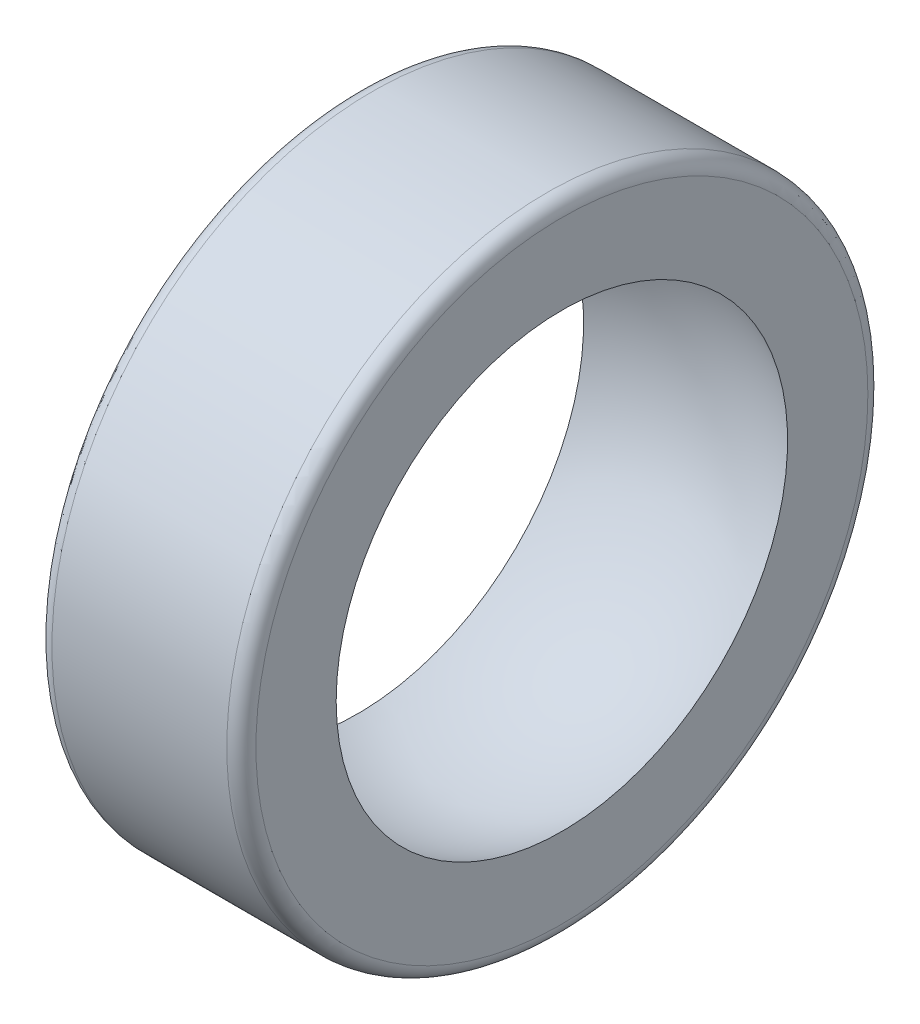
ISO-10303-21;
HEADER;
FILE_DESCRIPTION(('STEP AP214'),'2;1');
FILE_NAME('part.step','',(''),(''),'','','');
FILE_SCHEMA(('AUTOMOTIVE_DESIGN { 1 0 10303 214 1 1 1 1 }'));
ENDSEC;
DATA;
#1=APPLICATION_CONTEXT('core data for automotive mechanical design processes');
#2=APPLICATION_PROTOCOL_DEFINITION('international standard','automotive_design',2000,#1);
#3=PRODUCT_CONTEXT('',#1,'mechanical');
#4=PRODUCT('Part','Part','',(#3));
#5=PRODUCT_RELATED_PRODUCT_CATEGORY('part','',(#4));
#6=PRODUCT_DEFINITION_FORMATION('','',#4);
#7=PRODUCT_DEFINITION_CONTEXT('part definition',#1,'design');
#8=PRODUCT_DEFINITION('design','',#6,#7);
#9=PRODUCT_DEFINITION_SHAPE('','',#8);
#10=(LENGTH_UNIT() NAMED_UNIT(*) SI_UNIT(.MILLI.,.METRE.));
#11=(NAMED_UNIT(*) PLANE_ANGLE_UNIT() SI_UNIT($,.RADIAN.));
#12=(NAMED_UNIT(*) SI_UNIT($,.STERADIAN.) SOLID_ANGLE_UNIT());
#13=UNCERTAINTY_MEASURE_WITH_UNIT(LENGTH_MEASURE(1.E-05),#10,'distance_accuracy_value','');
#14=(GEOMETRIC_REPRESENTATION_CONTEXT(3) GLOBAL_UNCERTAINTY_ASSIGNED_CONTEXT((#13)) GLOBAL_UNIT_ASSIGNED_CONTEXT((#10,
#11,#12)) REPRESENTATION_CONTEXT('',''));
#15=CARTESIAN_POINT('',(0.,0.,0.));
#16=DIRECTION('',(0.,0.,1.));
#17=DIRECTION('',(1.,0.,0.));
#18=AXIS2_PLACEMENT_3D('',#15,#16,#17);
#19=CARTESIAN_POINT('',(0.,0.,0.));
#20=DIRECTION('',(0.,0.,1.));
#21=DIRECTION('',(1.,0.,0.));
#22=AXIS2_PLACEMENT_3D('',#19,#20,#21);
#23=SPHERICAL_SURFACE('',#22,8.5);
#24=CARTESIAN_POINT('',(0.,0.,0.));
#25=DIRECTION('',(-1.,0.,0.));
#26=DIRECTION('',(0.,0.,1.));
#27=AXIS2_PLACEMENT_3D('',#24,#25,#26);
#28=SPHERICAL_SURFACE('',#27,8.5);
#29=CARTESIAN_POINT('',(-3.5,0.,0.));
#30=DIRECTION('',(-1.,0.,0.));
#31=DIRECTION('',(0.,0.,1.));
#32=AXIS2_PLACEMENT_3D('',#29,#30,#31);
#33=CIRCLE('',#32,7.74596669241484);
#34=CARTESIAN_POINT('',(-3.5,0.,7.74596669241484));
#35=VERTEX_POINT('',#34);
#36=EDGE_CURVE('E54',#35,#35,#33,.T.);
#37=ORIENTED_EDGE('',*,*,#36,.T.);
#38=EDGE_LOOP('',(#37));
#39=FACE_BOUND('',#38,.T.);
#40=CARTESIAN_POINT('',(3.5,0.,0.));
#41=DIRECTION('',(-1.,0.,0.));
#42=DIRECTION('',(0.,0.,1.));
#43=AXIS2_PLACEMENT_3D('',#40,#41,#42);
#44=CIRCLE('',#43,7.74596669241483);
#45=CARTESIAN_POINT('',(3.5,0.,7.74596669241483));
#46=VERTEX_POINT('',#45);
#47=EDGE_CURVE('E51',#46,#46,#44,.T.);
#48=ORIENTED_EDGE('',*,*,#47,.F.);
#49=EDGE_LOOP('',(#48));
#50=FACE_BOUND('',#49,.T.);
#51=ADVANCED_FACE('F32',(#39,#50),#28,.F.);
#52=CARTESIAN_POINT('',(3.5,11.,0.));
#53=DIRECTION('',(1.,0.,0.));
#54=DIRECTION('',(0.,0.,-1.));
#55=AXIS2_PLACEMENT_3D('',#52,#53,#54);
#56=PLANE('',#55);
#57=CARTESIAN_POINT('',(3.5,0.,0.));
#58=DIRECTION('',(1.,0.,0.));
#59=DIRECTION('',(0.,0.,-1.));
#60=AXIS2_PLACEMENT_3D('',#57,#58,#59);
#61=CIRCLE('',#60,10.5);
#62=CARTESIAN_POINT('',(3.5,0.,-10.5));
#63=VERTEX_POINT('',#62);
#64=EDGE_CURVE('E38',#63,#63,#61,.T.);
#65=ORIENTED_EDGE('',*,*,#64,.T.);
#66=EDGE_LOOP('',(#65));
#67=FACE_BOUND('',#66,.T.);
#68=ORIENTED_EDGE('',*,*,#47,.T.);
#69=EDGE_LOOP('',(#68));
#70=FACE_BOUND('',#69,.T.);
#71=ADVANCED_FACE('F72',(#67,#70),#56,.T.);
#72=CARTESIAN_POINT('',(-60.,0.,0.));
#73=DIRECTION('',(-1.,0.,0.));
#74=DIRECTION('',(0.,0.,1.));
#75=AXIS2_PLACEMENT_3D('',#72,#73,#74);
#76=CYLINDRICAL_SURFACE('',#75,11.);
#77=CARTESIAN_POINT('',(3.,0.,0.));
#78=DIRECTION('',(1.,0.,0.));
#79=DIRECTION('',(0.,0.,-1.));
#80=AXIS2_PLACEMENT_3D('',#77,#78,#79);
#81=CIRCLE('',#80,11.);
#82=CARTESIAN_POINT('',(3.,0.,-11.));
#83=VERTEX_POINT('',#82);
#84=EDGE_CURVE('E42',#83,#83,#81,.F.);
#85=ORIENTED_EDGE('',*,*,#84,.T.);
#86=EDGE_LOOP('',(#85));
#87=FACE_BOUND('',#86,.T.);
#88=CARTESIAN_POINT('',(-3.,0.,0.));
#89=DIRECTION('',(1.,0.,0.));
#90=DIRECTION('',(0.,0.,-1.));
#91=AXIS2_PLACEMENT_3D('',#88,#89,#90);
#92=CIRCLE('',#91,11.);
#93=CARTESIAN_POINT('',(-3.,0.,-11.));
#94=VERTEX_POINT('',#93);
#95=EDGE_CURVE('E46',#94,#94,#92,.T.);
#96=ORIENTED_EDGE('',*,*,#95,.T.);
#97=EDGE_LOOP('',(#96));
#98=FACE_BOUND('',#97,.T.);
#99=ADVANCED_FACE('F63',(#87,#98),#76,.T.);
#100=CARTESIAN_POINT('',(-3.5,11.,0.));
#101=DIRECTION('',(1.,0.,0.));
#102=DIRECTION('',(0.,0.,-1.));
#103=AXIS2_PLACEMENT_3D('',#100,#101,#102);
#104=PLANE('',#103);
#105=CARTESIAN_POINT('',(-3.5,0.,0.));
#106=DIRECTION('',(1.,0.,0.));
#107=DIRECTION('',(0.,0.,-1.));
#108=AXIS2_PLACEMENT_3D('',#105,#106,#107);
#109=CIRCLE('',#108,10.5);
#110=CARTESIAN_POINT('',(-3.5,0.,-10.5));
#111=VERTEX_POINT('',#110);
#112=EDGE_CURVE('E10',#111,#111,#109,.F.);
#113=ORIENTED_EDGE('',*,*,#112,.T.);
#114=EDGE_LOOP('',(#113));
#115=FACE_BOUND('',#114,.T.);
#116=ORIENTED_EDGE('',*,*,#36,.F.);
#117=EDGE_LOOP('',(#116));
#118=FACE_BOUND('',#117,.T.);
#119=ADVANCED_FACE('F60',(#115,#118),#104,.F.);
#120=CARTESIAN_POINT('',(3.,0.,0.));
#121=DIRECTION('',(1.,0.,0.));
#122=DIRECTION('',(0.,0.,-1.));
#123=AXIS2_PLACEMENT_3D('',#120,#121,#122);
#124=TOROIDAL_SURFACE('',#123,10.5,0.5);
#125=ORIENTED_EDGE('',*,*,#64,.F.);
#126=EDGE_LOOP('',(#125));
#127=FACE_BOUND('',#126,.T.);
#128=ORIENTED_EDGE('',*,*,#84,.F.);
#129=EDGE_LOOP('',(#128));
#130=FACE_BOUND('',#129,.T.);
#131=ADVANCED_FACE('F62',(#127,#130),#124,.T.);
#132=CARTESIAN_POINT('',(-3.,0.,0.));
#133=DIRECTION('',(1.,0.,0.));
#134=DIRECTION('',(0.,0.,-1.));
#135=AXIS2_PLACEMENT_3D('',#132,#133,#134);
#136=TOROIDAL_SURFACE('',#135,10.5,0.5);
#137=ORIENTED_EDGE('',*,*,#95,.F.);
#138=EDGE_LOOP('',(#137));
#139=FACE_BOUND('',#138,.T.);
#140=ORIENTED_EDGE('',*,*,#112,.F.);
#141=EDGE_LOOP('',(#140));
#142=FACE_BOUND('',#141,.T.);
#143=ADVANCED_FACE('F69',(#139,#142),#136,.T.);
#144=CLOSED_SHELL('',(#51,#71,#99,#119,#131,#143));
#145=MANIFOLD_SOLID_BREP('B2',#144);
#146=ADVANCED_BREP_SHAPE_REPRESENTATION('',(#18,#145),#14);
#147=SHAPE_DEFINITION_REPRESENTATION(#9,#146);
ENDSEC;
END-ISO-10303-21;
